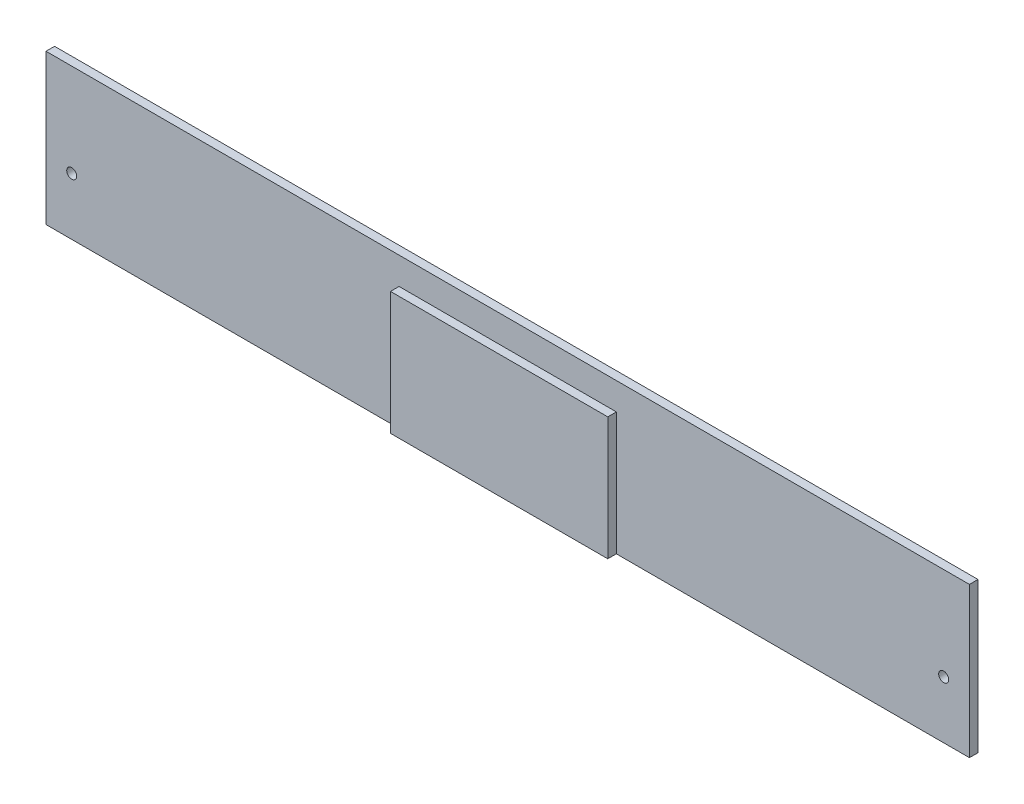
from build123d import *

# Parameters (mm, degrees)
SKETCH1_W               = 323
SKETCH1_H               = 50
BOSS_EXTRUDE1_DEPTH     = 3
CUT_EXTRUDE1_DEPTH      = 164.451063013
CUT_EXTRUDE1_DEPTH_BACK = 164.451063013
SKETCH2_W               = 70
SKETCH2_H               = 40
FILLET1_R               = 2
SKETCH3_W               = 323
SKETCH3_H               = 3
BOSS_EXTRUDE2_DEPTH     = 2.5
SKETCH4_R               = 1.75
CUT_EXTRUDE2_DEPTH      = 164.852067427
BOSS_EXTRUDE3_START     = -3
BOSS_EXTRUDE3_DEPTH     = 76
BOSS_EXTRUDE4_START     = -3
SKETCH5_3_W             = 3
SKETCH5_3_H             = 2
BOSS_EXTRUDE4_DEPTH     = 76


with BuildPart() as part:
    # Sketch1 → Boss-Extrude1 (new body)
    with BuildSketch(Plane.XY):
        Rectangle(SKETCH1_W, SKETCH1_H)
    extrude(amount=BOSS_EXTRUDE1_DEPTH)

    # Sketch2 → Cut-Extrude1 (cut, two sides: drawn at the far end of the back side and taken through both)
    with BuildSketch(Plane.XY.offset(3).offset(-CUT_EXTRUDE1_DEPTH_BACK)):
        with Locations((0, -5)):
            Rectangle(SKETCH2_W, SKETCH2_H)
    extrude(amount=CUT_EXTRUDE1_DEPTH + CUT_EXTRUDE1_DEPTH_BACK, mode=Mode.SUBTRACT)

    # Fillet1
    fillet1_edges = [part.edges().sort_by_distance(p)[0] for p in [
        (-35, 15, 1.5),
        (35, 15, 1.5),
    ]]
    fillet(fillet1_edges, radius=FILLET1_R)

    # Sketch3 → Boss-Extrude2 (add)
    with BuildSketch(Plane(origin=(0, 25, 0), x_dir=(1, 0, 0), z_dir=(0, 1, 0))):
        with Locations((0, -1.5)):
            Rectangle(SKETCH3_W, SKETCH3_H)
    extrude(amount=BOSS_EXTRUDE2_DEPTH)

    # Sketch4 → Cut-Extrude2 (cut, through all)
    with BuildSketch(Plane.XY.offset(3)):
        with Locations((-152.5, -5)):
            Circle(SKETCH4_R)
        with Locations(Location((152.5, -5, 0), (0, 0, 180))):
            Circle(SKETCH4_R)
    extrude(amount=-CUT_EXTRUDE2_DEPTH, mode=Mode.SUBTRACT)



with BuildPart() as body_2:
    # Sketch5 → Boss-Extrude3 (new body)
    with BuildSketch(Plane.ZY.offset(-35).offset(BOSS_EXTRUDE3_START)):
        Polygon((3, -23), (3, -25), (6, -25), (6, 18), (3, 18), (3, 15), (3, 13), align=None)
    extrude(amount=BOSS_EXTRUDE3_DEPTH)


with BuildPart() as part_1:
    add(part.part)

    add(body_2.part)  # Boss-Extrude4 merges body 2
    # Sketch5_3 → Boss-Extrude4 (add)
    with BuildSketch(Plane.ZY.offset(-35).offset(BOSS_EXTRUDE4_START)):
        with BuildLine():
            Line((-40, -25), (0, -25))
            Line((0, -25), (0, -23))
            Line((0, -23), (-39.949968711, -23))
            ThreePointArc((-39.949968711, -23), (-39.987490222, -23.999687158), (-40, -25))
        make_face()
        with Locations((1.5, -24)):
            Rectangle(SKETCH5_3_W, SKETCH5_3_H)
        with BuildLine():
            Line((-43, -25), (-40, -25))
            ThreePointArc((-40, -25), (-39.987490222, -23.999687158), (-39.949968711, -23))
            Line((-39.949968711, -23), (-43, -23))
            Line((-43, -23), (-43, -25))
        make_face()
    extrude(amount=BOSS_EXTRUDE4_DEPTH)


solid = part_1.part
